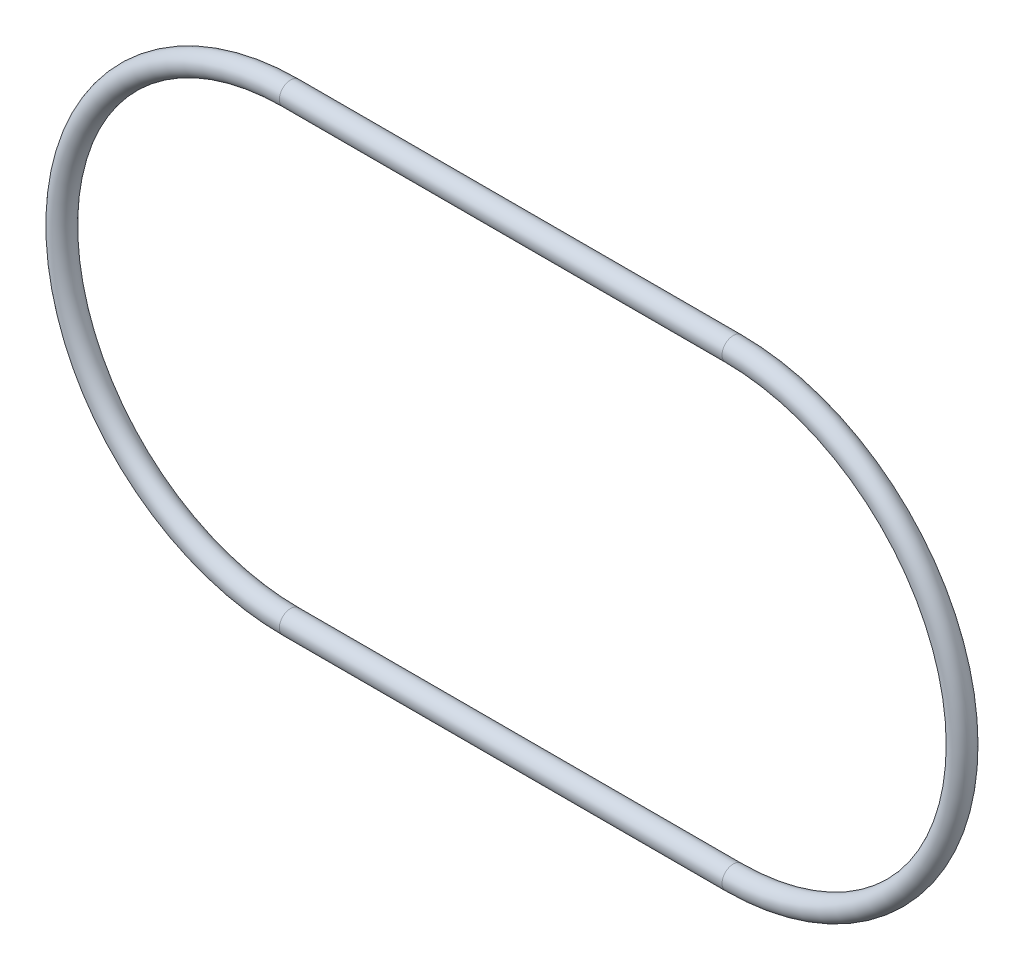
ISO-10303-21;
HEADER;
FILE_DESCRIPTION(('STEP AP214'),'2;1');
FILE_NAME('part.step','',(''),(''),'','','');
FILE_SCHEMA(('AUTOMOTIVE_DESIGN { 1 0 10303 214 1 1 1 1 }'));
ENDSEC;
DATA;
#1=APPLICATION_CONTEXT('core data for automotive mechanical design processes');
#2=APPLICATION_PROTOCOL_DEFINITION('international standard','automotive_design',2000,#1);
#3=PRODUCT_CONTEXT('',#1,'mechanical');
#4=PRODUCT('Part','Part','',(#3));
#5=PRODUCT_RELATED_PRODUCT_CATEGORY('part','',(#4));
#6=PRODUCT_DEFINITION_FORMATION('','',#4);
#7=PRODUCT_DEFINITION_CONTEXT('part definition',#1,'design');
#8=PRODUCT_DEFINITION('design','',#6,#7);
#9=PRODUCT_DEFINITION_SHAPE('','',#8);
#10=(LENGTH_UNIT() NAMED_UNIT(*) SI_UNIT(.MILLI.,.METRE.));
#11=(NAMED_UNIT(*) PLANE_ANGLE_UNIT() SI_UNIT($,.RADIAN.));
#12=(NAMED_UNIT(*) SI_UNIT($,.STERADIAN.) SOLID_ANGLE_UNIT());
#13=UNCERTAINTY_MEASURE_WITH_UNIT(LENGTH_MEASURE(1.E-05),#10,'distance_accuracy_value','');
#14=(GEOMETRIC_REPRESENTATION_CONTEXT(3) GLOBAL_UNCERTAINTY_ASSIGNED_CONTEXT((#13)) GLOBAL_UNIT_ASSIGNED_CONTEXT((#10,
#11,#12)) REPRESENTATION_CONTEXT('',''));
#15=CARTESIAN_POINT('',(0.,0.,0.));
#16=DIRECTION('',(0.,0.,1.));
#17=DIRECTION('',(1.,0.,0.));
#18=AXIS2_PLACEMENT_3D('',#15,#16,#17);
#19=CARTESIAN_POINT('',(29.5,0.,0.));
#20=DIRECTION('',(0.,0.,1.));
#21=DIRECTION('',(0.,1.,0.));
#22=AXIS2_PLACEMENT_3D('',#19,#20,#21);
#23=TOROIDAL_SURFACE('',#22,30.5,1.5);
#24=CARTESIAN_POINT('',(29.5,30.5,0.));
#25=DIRECTION('',(-1.,0.,0.));
#26=DIRECTION('',(0.,0.,1.));
#27=AXIS2_PLACEMENT_3D('',#24,#25,#26);
#28=CIRCLE('',#27,1.5);
#29=CARTESIAN_POINT('',(29.5,30.5,1.5));
#30=VERTEX_POINT('',#29);
#31=EDGE_CURVE('E26',#30,#30,#28,.T.);
#32=ORIENTED_EDGE('',*,*,#31,.F.);
#33=EDGE_LOOP('',(#32));
#34=FACE_BOUND('',#33,.T.);
#35=CARTESIAN_POINT('',(29.5,-30.5,0.));
#36=DIRECTION('',(1.,0.,0.));
#37=DIRECTION('',(0.,0.,-1.));
#38=AXIS2_PLACEMENT_3D('',#35,#36,#37);
#39=CIRCLE('',#38,1.5);
#40=CARTESIAN_POINT('',(29.5,-30.5,-1.5));
#41=VERTEX_POINT('',#40);
#42=EDGE_CURVE('E32',#41,#41,#39,.F.);
#43=ORIENTED_EDGE('',*,*,#42,.F.);
#44=EDGE_LOOP('',(#43));
#45=FACE_BOUND('',#44,.T.);
#46=ADVANCED_FACE('F14',(#34,#45),#23,.T.);
#47=CARTESIAN_POINT('',(-29.5,-30.5,0.));
#48=DIRECTION('',(1.,0.,0.));
#49=DIRECTION('',(0.,0.,-1.));
#50=AXIS2_PLACEMENT_3D('',#47,#48,#49);
#51=CYLINDRICAL_SURFACE('',#50,1.5);
#52=ORIENTED_EDGE('',*,*,#42,.T.);
#53=EDGE_LOOP('',(#52));
#54=FACE_BOUND('',#53,.T.);
#55=CARTESIAN_POINT('',(-29.5,-30.5,0.));
#56=DIRECTION('',(1.,0.,0.));
#57=DIRECTION('',(0.,-1.,0.));
#58=AXIS2_PLACEMENT_3D('',#55,#56,#57);
#59=CIRCLE('',#58,1.5);
#60=CARTESIAN_POINT('',(-29.5,-32.,0.));
#61=VERTEX_POINT('',#60);
#62=EDGE_CURVE('E21',#61,#61,#59,.F.);
#63=ORIENTED_EDGE('',*,*,#62,.F.);
#64=EDGE_LOOP('',(#63));
#65=FACE_BOUND('',#64,.T.);
#66=ADVANCED_FACE('F36',(#54,#65),#51,.T.);
#67=CARTESIAN_POINT('',(29.5,30.5,0.));
#68=DIRECTION('',(-1.,0.,0.));
#69=DIRECTION('',(0.,0.,1.));
#70=AXIS2_PLACEMENT_3D('',#67,#68,#69);
#71=CYLINDRICAL_SURFACE('',#70,1.5);
#72=CARTESIAN_POINT('',(-29.5,30.5,0.));
#73=DIRECTION('',(-1.,0.,0.));
#74=DIRECTION('',(0.,1.,0.));
#75=AXIS2_PLACEMENT_3D('',#72,#73,#74);
#76=CIRCLE('',#75,1.5);
#77=CARTESIAN_POINT('',(-29.5,32.,0.));
#78=VERTEX_POINT('',#77);
#79=EDGE_CURVE('E9',#78,#78,#76,.T.);
#80=ORIENTED_EDGE('',*,*,#79,.F.);
#81=EDGE_LOOP('',(#80));
#82=FACE_BOUND('',#81,.T.);
#83=ORIENTED_EDGE('',*,*,#31,.T.);
#84=EDGE_LOOP('',(#83));
#85=FACE_BOUND('',#84,.T.);
#86=ADVANCED_FACE('F45',(#82,#85),#71,.T.);
#87=CARTESIAN_POINT('',(-29.5,0.,0.));
#88=DIRECTION('',(0.,0.,1.));
#89=DIRECTION('',(0.,-1.,0.));
#90=AXIS2_PLACEMENT_3D('',#87,#88,#89);
#91=TOROIDAL_SURFACE('',#90,30.5,1.5);
#92=ORIENTED_EDGE('',*,*,#62,.T.);
#93=EDGE_LOOP('',(#92));
#94=FACE_BOUND('',#93,.T.);
#95=ORIENTED_EDGE('',*,*,#79,.T.);
#96=EDGE_LOOP('',(#95));
#97=FACE_BOUND('',#96,.T.);
#98=ADVANCED_FACE('F47',(#94,#97),#91,.T.);
#99=CLOSED_SHELL('',(#46,#66,#86,#98));
#100=MANIFOLD_SOLID_BREP('B1',#99);
#101=ADVANCED_BREP_SHAPE_REPRESENTATION('',(#18,#100),#14);
#102=SHAPE_DEFINITION_REPRESENTATION(#9,#101);
ENDSEC;
END-ISO-10303-21;
